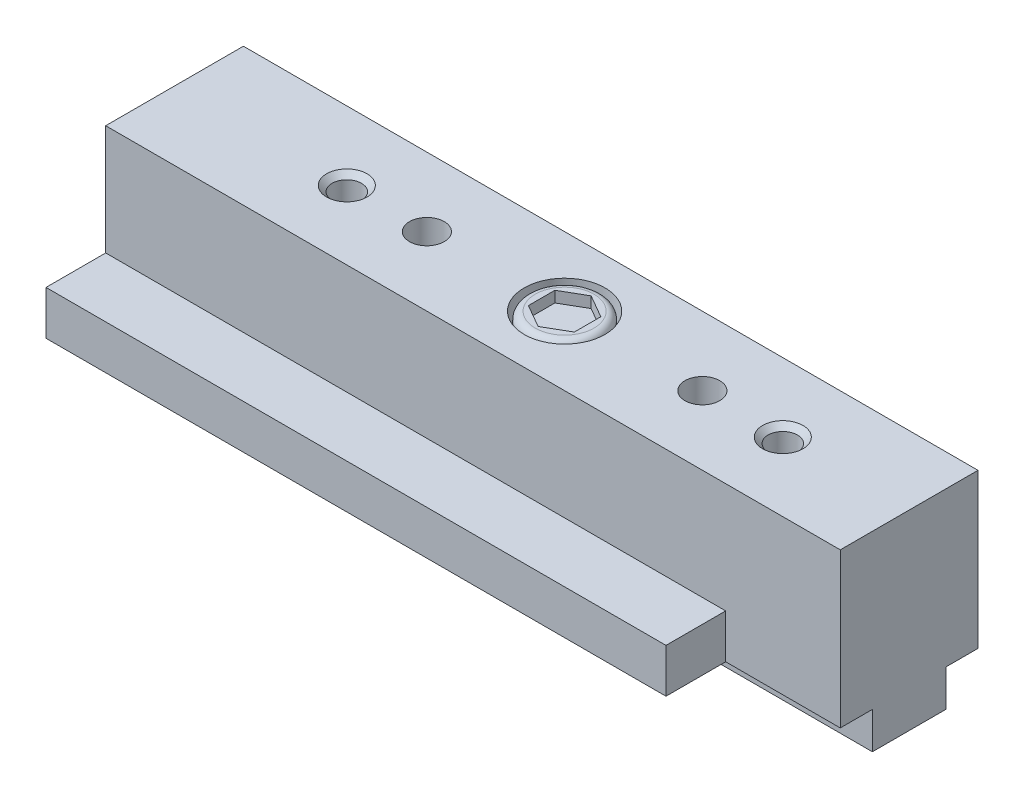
ISO-10303-21;
HEADER;
FILE_DESCRIPTION(('STEP AP214'),'2;1');
FILE_NAME('part.step','',(''),(''),'','','');
FILE_SCHEMA(('AUTOMOTIVE_DESIGN { 1 0 10303 214 1 1 1 1 }'));
ENDSEC;
DATA;
#1=APPLICATION_CONTEXT('core data for automotive mechanical design processes');
#2=APPLICATION_PROTOCOL_DEFINITION('international standard','automotive_design',2000,#1);
#3=PRODUCT_CONTEXT('',#1,'mechanical');
#4=PRODUCT('Part','Part','',(#3));
#5=PRODUCT_RELATED_PRODUCT_CATEGORY('part','',(#4));
#6=PRODUCT_DEFINITION_FORMATION('','',#4);
#7=PRODUCT_DEFINITION_CONTEXT('part definition',#1,'design');
#8=PRODUCT_DEFINITION('design','',#6,#7);
#9=PRODUCT_DEFINITION_SHAPE('','',#8);
#10=(LENGTH_UNIT() NAMED_UNIT(*) SI_UNIT(.MILLI.,.METRE.));
#11=(NAMED_UNIT(*) PLANE_ANGLE_UNIT() SI_UNIT($,.RADIAN.));
#12=(NAMED_UNIT(*) SI_UNIT($,.STERADIAN.) SOLID_ANGLE_UNIT());
#13=UNCERTAINTY_MEASURE_WITH_UNIT(LENGTH_MEASURE(1.E-05),#10,'distance_accuracy_value','');
#14=(GEOMETRIC_REPRESENTATION_CONTEXT(3) GLOBAL_UNCERTAINTY_ASSIGNED_CONTEXT((#13)) GLOBAL_UNIT_ASSIGNED_CONTEXT((#10,
#11,#12)) REPRESENTATION_CONTEXT('',''));
#15=CARTESIAN_POINT('',(0.,0.,0.));
#16=DIRECTION('',(0.,0.,1.));
#17=DIRECTION('',(1.,0.,0.));
#18=AXIS2_PLACEMENT_3D('',#15,#16,#17);
#19=CARTESIAN_POINT('',(26.9748,11.684,0.));
#20=DIRECTION('',(0.,1.,0.));
#21=DIRECTION('',(0.,0.,1.));
#22=AXIS2_PLACEMENT_3D('',#19,#20,#21);
#23=PLANE('',#22);
#24=CARTESIAN_POINT('',(26.9748,11.684,0.));
#25=DIRECTION('',(0.,1.,0.));
#26=DIRECTION('',(0.,0.,1.));
#27=AXIS2_PLACEMENT_3D('',#24,#25,#26);
#28=CIRCLE('',#27,2.794);
#29=CARTESIAN_POINT('',(26.9748,11.684,2.794));
#30=VERTEX_POINT('',#29);
#31=EDGE_CURVE('E242',#30,#30,#28,.T.);
#32=ORIENTED_EDGE('',*,*,#31,.T.);
#33=EDGE_LOOP('',(#32));
#34=FACE_BOUND('',#33,.T.);
#35=CARTESIAN_POINT('',(26.9748,11.684,0.));
#36=DIRECTION('',(0.,1.,0.));
#37=DIRECTION('',(0.,0.,1.));
#38=AXIS2_PLACEMENT_3D('',#35,#36,#37);
#39=CIRCLE('',#38,2.54);
#40=CARTESIAN_POINT('',(26.9748,11.684,2.54));
#41=VERTEX_POINT('',#40);
#42=EDGE_CURVE('E225',#41,#41,#39,.T.);
#43=ORIENTED_EDGE('',*,*,#42,.F.);
#44=EDGE_LOOP('',(#43));
#45=FACE_BOUND('',#44,.T.);
#46=ADVANCED_FACE('F33',(#34,#45),#23,.T.);
#47=CARTESIAN_POINT('',(42.8752,13.208,-4.7625));
#48=DIRECTION('',(0.,-1.,0.));
#49=DIRECTION('',(0.,0.,-1.));
#50=AXIS2_PLACEMENT_3D('',#47,#48,#49);
#51=PLANE('',#50);
#52=CARTESIAN_POINT('',(26.9748,13.208,0.));
#53=DIRECTION('',(0.,1.,0.));
#54=DIRECTION('',(0.,0.,1.));
#55=AXIS2_PLACEMENT_3D('',#52,#53,#54);
#56=CIRCLE('',#55,2.794);
#57=CARTESIAN_POINT('',(26.9748,13.208,2.794));
#58=VERTEX_POINT('',#57);
#59=EDGE_CURVE('E241',#58,#58,#56,.T.);
#60=ORIENTED_EDGE('',*,*,#59,.F.);
#61=EDGE_LOOP('',(#60));
#62=FACE_BOUND('',#61,.T.);
#63=CARTESIAN_POINT('',(17.4498,13.208,0.));
#64=DIRECTION('',(0.,1.,0.));
#65=DIRECTION('',(0.,0.,1.));
#66=AXIS2_PLACEMENT_3D('',#63,#64,#65);
#67=CIRCLE('',#66,1.20269);
#68=CARTESIAN_POINT('',(17.4498,13.208,1.20269));
#69=VERTEX_POINT('',#68);
#70=EDGE_CURVE('E245',#69,#69,#67,.T.);
#71=ORIENTED_EDGE('',*,*,#70,.F.);
#72=EDGE_LOOP('',(#71));
#73=FACE_BOUND('',#72,.T.);
#74=CARTESIAN_POINT('',(36.4998,13.208,0.));
#75=DIRECTION('',(0.,1.,0.));
#76=DIRECTION('',(0.,0.,1.));
#77=AXIS2_PLACEMENT_3D('',#74,#75,#76);
#78=CIRCLE('',#77,1.20269);
#79=CARTESIAN_POINT('',(36.4998,13.208,1.20269));
#80=VERTEX_POINT('',#79);
#81=EDGE_CURVE('E251',#80,#80,#78,.T.);
#82=ORIENTED_EDGE('',*,*,#81,.F.);
#83=EDGE_LOOP('',(#82));
#84=FACE_BOUND('',#83,.T.);
#85=CARTESIAN_POINT('',(42.0624,13.208,0.));
#86=DIRECTION('',(0.,1.,0.));
#87=DIRECTION('',(0.,0.,1.));
#88=AXIS2_PLACEMENT_3D('',#85,#86,#87);
#89=CIRCLE('',#88,1.397);
#90=CARTESIAN_POINT('',(42.0624,13.208,1.397));
#91=VERTEX_POINT('',#90);
#92=EDGE_CURVE('E274',#91,#91,#89,.T.);
#93=ORIENTED_EDGE('',*,*,#92,.F.);
#94=EDGE_LOOP('',(#93));
#95=FACE_BOUND('',#94,.T.);
#96=DIRECTION('',(0.,0.,1.));
#97=VECTOR('',#96,1.);
#98=CARTESIAN_POINT('',(0.,13.208,-4.7625));
#99=LINE('',#98,#97);
#100=CARTESIAN_POINT('',(0.,13.208,-4.7625));
#101=VERTEX_POINT('',#100);
#102=CARTESIAN_POINT('',(0.,13.208,4.7625));
#103=VERTEX_POINT('',#102);
#104=EDGE_CURVE('E400',#101,#103,#99,.T.);
#105=ORIENTED_EDGE('',*,*,#104,.T.);
#106=DIRECTION('',(-1.,0.,0.));
#107=VECTOR('',#106,1.);
#108=CARTESIAN_POINT('',(42.8752,13.208,4.7625));
#109=LINE('',#108,#107);
#110=CARTESIAN_POINT('',(50.8,13.208,4.7625));
#111=VERTEX_POINT('',#110);
#112=EDGE_CURVE('E336',#111,#103,#109,.T.);
#113=ORIENTED_EDGE('',*,*,#112,.F.);
#114=DIRECTION('',(0.,0.,1.));
#115=VECTOR('',#114,1.);
#116=CARTESIAN_POINT('',(50.8,13.208,-4.7625));
#117=LINE('',#116,#115);
#118=CARTESIAN_POINT('',(50.8,13.208,-4.7625));
#119=VERTEX_POINT('',#118);
#120=EDGE_CURVE('E297',#119,#111,#117,.T.);
#121=ORIENTED_EDGE('',*,*,#120,.F.);
#122=DIRECTION('',(-1.,0.,0.));
#123=VECTOR('',#122,1.);
#124=CARTESIAN_POINT('',(42.8752,13.208,-4.7625));
#125=LINE('',#124,#123);
#126=EDGE_CURVE('E320',#119,#101,#125,.T.);
#127=ORIENTED_EDGE('',*,*,#126,.T.);
#128=EDGE_LOOP('',(#105,#113,#121,#127));
#129=FACE_BOUND('',#128,.T.);
#130=CARTESIAN_POINT('',(11.9126,13.208,0.));
#131=DIRECTION('',(0.,1.,0.));
#132=DIRECTION('',(0.,0.,1.));
#133=AXIS2_PLACEMENT_3D('',#130,#131,#132);
#134=CIRCLE('',#133,1.397);
#135=CARTESIAN_POINT('',(11.9126,13.208,1.397));
#136=VERTEX_POINT('',#135);
#137=EDGE_CURVE('E265',#136,#136,#134,.T.);
#138=ORIENTED_EDGE('',*,*,#137,.F.);
#139=EDGE_LOOP('',(#138));
#140=FACE_BOUND('',#139,.T.);
#141=ADVANCED_FACE('F428',(#62,#73,#84,#95,#129,#140),#51,.F.);
#142=CARTESIAN_POINT('',(42.8752,2.54,8.89));
#143=DIRECTION('',(1.,0.,0.));
#144=DIRECTION('',(0.,0.,-1.));
#145=AXIS2_PLACEMENT_3D('',#142,#143,#144);
#146=PLANE('',#145);
#147=DIRECTION('',(0.,-1.,0.));
#148=VECTOR('',#147,1.);
#149=CARTESIAN_POINT('',(42.8752,13.208,4.7625));
#150=LINE('',#149,#148);
#151=CARTESIAN_POINT('',(42.8752,5.588,4.7625));
#152=VERTEX_POINT('',#151);
#153=CARTESIAN_POINT('',(42.8752,2.54,4.7625));
#154=VERTEX_POINT('',#153);
#155=EDGE_CURVE('E11',#152,#154,#150,.T.);
#156=ORIENTED_EDGE('',*,*,#155,.F.);
#157=DIRECTION('',(0.,0.,1.));
#158=VECTOR('',#157,1.);
#159=CARTESIAN_POINT('',(42.8752,5.588,4.7625));
#160=LINE('',#159,#158);
#161=CARTESIAN_POINT('',(42.8752,5.588,8.89));
#162=VERTEX_POINT('',#161);
#163=EDGE_CURVE('E312',#152,#162,#160,.T.);
#164=ORIENTED_EDGE('',*,*,#163,.T.);
#165=DIRECTION('',(0.,-1.,0.));
#166=VECTOR('',#165,1.);
#167=CARTESIAN_POINT('',(42.8752,5.588,8.89));
#168=LINE('',#167,#166);
#169=CARTESIAN_POINT('',(42.8752,2.54,8.89));
#170=VERTEX_POINT('',#169);
#171=EDGE_CURVE('E377',#162,#170,#168,.T.);
#172=ORIENTED_EDGE('',*,*,#171,.T.);
#173=DIRECTION('',(0.,0.,-1.));
#174=VECTOR('',#173,1.);
#175=CARTESIAN_POINT('',(42.8752,2.54,8.89));
#176=LINE('',#175,#174);
#177=EDGE_CURVE('E375',#170,#154,#176,.T.);
#178=ORIENTED_EDGE('',*,*,#177,.T.);
#179=EDGE_LOOP('',(#156,#164,#172,#178));
#180=FACE_BOUND('',#179,.T.);
#181=ADVANCED_FACE('F408',(#180),#146,.T.);
#182=CARTESIAN_POINT('',(42.8752,5.588,8.89));
#183=DIRECTION('',(0.,0.,-1.));
#184=DIRECTION('',(-1.,0.,0.));
#185=AXIS2_PLACEMENT_3D('',#182,#183,#184);
#186=PLANE('',#185);
#187=DIRECTION('',(0.,-1.,0.));
#188=VECTOR('',#187,1.);
#189=CARTESIAN_POINT('',(0.,5.588,8.89));
#190=LINE('',#189,#188);
#191=CARTESIAN_POINT('',(0.,5.588,8.89));
#192=VERTEX_POINT('',#191);
#193=CARTESIAN_POINT('',(0.,2.54,8.89));
#194=VERTEX_POINT('',#193);
#195=EDGE_CURVE('E330',#192,#194,#190,.T.);
#196=ORIENTED_EDGE('',*,*,#195,.T.);
#197=DIRECTION('',(-1.,0.,0.));
#198=VECTOR('',#197,1.);
#199=CARTESIAN_POINT('',(42.8752,2.54,8.89));
#200=LINE('',#199,#198);
#201=EDGE_CURVE('E42',#170,#194,#200,.T.);
#202=ORIENTED_EDGE('',*,*,#201,.F.);
#203=ORIENTED_EDGE('',*,*,#171,.F.);
#204=DIRECTION('',(-1.,0.,0.));
#205=VECTOR('',#204,1.);
#206=CARTESIAN_POINT('',(42.8752,5.588,8.89));
#207=LINE('',#206,#205);
#208=EDGE_CURVE('E337',#162,#192,#207,.T.);
#209=ORIENTED_EDGE('',*,*,#208,.T.);
#210=EDGE_LOOP('',(#196,#202,#203,#209));
#211=FACE_BOUND('',#210,.T.);
#212=ADVANCED_FACE('F35',(#211),#186,.F.);
#213=CARTESIAN_POINT('',(42.8752,2.54,8.89));
#214=DIRECTION('',(0.,1.,0.));
#215=DIRECTION('',(0.,0.,1.));
#216=AXIS2_PLACEMENT_3D('',#213,#214,#215);
#217=PLANE('',#216);
#218=DIRECTION('',(0.,0.,-1.));
#219=VECTOR('',#218,1.);
#220=CARTESIAN_POINT('',(0.,2.54,8.89));
#221=LINE('',#220,#219);
#222=CARTESIAN_POINT('',(0.,2.54,2.54));
#223=VERTEX_POINT('',#222);
#224=EDGE_CURVE('E384',#194,#223,#221,.T.);
#225=ORIENTED_EDGE('',*,*,#224,.T.);
#226=DIRECTION('',(-1.,0.,0.));
#227=VECTOR('',#226,1.);
#228=CARTESIAN_POINT('',(42.8752,2.54,2.54));
#229=LINE('',#228,#227);
#230=CARTESIAN_POINT('',(50.8,2.54,2.54));
#231=VERTEX_POINT('',#230);
#232=EDGE_CURVE('E371',#231,#223,#229,.T.);
#233=ORIENTED_EDGE('',*,*,#232,.F.);
#234=DIRECTION('',(0.,0.,-1.));
#235=VECTOR('',#234,1.);
#236=CARTESIAN_POINT('',(50.8,2.54,4.7625));
#237=LINE('',#236,#235);
#238=CARTESIAN_POINT('',(50.8,2.54,4.7625));
#239=VERTEX_POINT('',#238);
#240=EDGE_CURVE('E280',#239,#231,#237,.T.);
#241=ORIENTED_EDGE('',*,*,#240,.F.);
#242=DIRECTION('',(-1.,0.,0.));
#243=VECTOR('',#242,1.);
#244=CARTESIAN_POINT('',(50.8,2.54,4.7625));
#245=LINE('',#244,#243);
#246=EDGE_CURVE('E325',#239,#154,#245,.T.);
#247=ORIENTED_EDGE('',*,*,#246,.T.);
#248=ORIENTED_EDGE('',*,*,#177,.F.);
#249=ORIENTED_EDGE('',*,*,#201,.T.);
#250=EDGE_LOOP('',(#225,#233,#241,#247,#248,#249));
#251=FACE_BOUND('',#250,.T.);
#252=ADVANCED_FACE('F410',(#251),#217,.F.);
#253=CARTESIAN_POINT('',(42.8752,2.54,2.54));
#254=DIRECTION('',(0.,0.,-1.));
#255=DIRECTION('',(-1.,0.,0.));
#256=AXIS2_PLACEMENT_3D('',#253,#254,#255);
#257=PLANE('',#256);
#258=DIRECTION('',(0.,-1.,0.));
#259=VECTOR('',#258,1.);
#260=CARTESIAN_POINT('',(0.,2.54,2.54));
#261=LINE('',#260,#259);
#262=CARTESIAN_POINT('',(0.,0.,2.54));
#263=VERTEX_POINT('',#262);
#264=EDGE_CURVE('E386',#223,#263,#261,.T.);
#265=ORIENTED_EDGE('',*,*,#264,.T.);
#266=DIRECTION('',(-1.,0.,0.));
#267=VECTOR('',#266,1.);
#268=CARTESIAN_POINT('',(42.8752,0.,2.54));
#269=LINE('',#268,#267);
#270=CARTESIAN_POINT('',(50.8,0.,2.54));
#271=VERTEX_POINT('',#270);
#272=EDGE_CURVE('E368',#271,#263,#269,.T.);
#273=ORIENTED_EDGE('',*,*,#272,.F.);
#274=DIRECTION('',(0.,-1.,0.));
#275=VECTOR('',#274,1.);
#276=CARTESIAN_POINT('',(50.8,2.54,2.54));
#277=LINE('',#276,#275);
#278=EDGE_CURVE('E283',#231,#271,#277,.T.);
#279=ORIENTED_EDGE('',*,*,#278,.F.);
#280=ORIENTED_EDGE('',*,*,#232,.T.);
#281=EDGE_LOOP('',(#265,#273,#279,#280));
#282=FACE_BOUND('',#281,.T.);
#283=ADVANCED_FACE('F496',(#282),#257,.F.);
#284=CARTESIAN_POINT('',(42.8752,0.,2.54));
#285=DIRECTION('',(0.,1.,0.));
#286=DIRECTION('',(0.,0.,1.));
#287=AXIS2_PLACEMENT_3D('',#284,#285,#286);
#288=PLANE('',#287);
#289=DIRECTION('',(0.,0.,-1.));
#290=VECTOR('',#289,1.);
#291=CARTESIAN_POINT('',(0.,0.,2.54));
#292=LINE('',#291,#290);
#293=CARTESIAN_POINT('',(0.,0.,-2.54));
#294=VERTEX_POINT('',#293);
#295=EDGE_CURVE('E388',#263,#294,#292,.T.);
#296=ORIENTED_EDGE('',*,*,#295,.T.);
#297=DIRECTION('',(-1.,0.,0.));
#298=VECTOR('',#297,1.);
#299=CARTESIAN_POINT('',(42.8752,0.,-2.54));
#300=LINE('',#299,#298);
#301=CARTESIAN_POINT('',(50.8,0.,-2.54));
#302=VERTEX_POINT('',#301);
#303=EDGE_CURVE('E365',#302,#294,#300,.T.);
#304=ORIENTED_EDGE('',*,*,#303,.F.);
#305=DIRECTION('',(0.,0.,-1.));
#306=VECTOR('',#305,1.);
#307=CARTESIAN_POINT('',(50.8,0.,2.54));
#308=LINE('',#307,#306);
#309=EDGE_CURVE('E286',#271,#302,#308,.T.);
#310=ORIENTED_EDGE('',*,*,#309,.F.);
#311=ORIENTED_EDGE('',*,*,#272,.T.);
#312=EDGE_LOOP('',(#296,#304,#310,#311));
#313=FACE_BOUND('',#312,.T.);
#314=ADVANCED_FACE('F500',(#313),#288,.F.);
#315=CARTESIAN_POINT('',(42.8752,0.,-2.54));
#316=DIRECTION('',(0.,0.,1.));
#317=DIRECTION('',(1.,0.,0.));
#318=AXIS2_PLACEMENT_3D('',#315,#316,#317);
#319=PLANE('',#318);
#320=DIRECTION('',(0.,1.,0.));
#321=VECTOR('',#320,1.);
#322=CARTESIAN_POINT('',(0.,0.,-2.54));
#323=LINE('',#322,#321);
#324=CARTESIAN_POINT('',(0.,2.54,-2.54));
#325=VERTEX_POINT('',#324);
#326=EDGE_CURVE('E390',#294,#325,#323,.T.);
#327=ORIENTED_EDGE('',*,*,#326,.T.);
#328=DIRECTION('',(-1.,0.,0.));
#329=VECTOR('',#328,1.);
#330=CARTESIAN_POINT('',(42.8752,2.54,-2.54));
#331=LINE('',#330,#329);
#332=CARTESIAN_POINT('',(50.8,2.54,-2.54));
#333=VERTEX_POINT('',#332);
#334=EDGE_CURVE('E362',#333,#325,#331,.T.);
#335=ORIENTED_EDGE('',*,*,#334,.F.);
#336=DIRECTION('',(0.,1.,0.));
#337=VECTOR('',#336,1.);
#338=CARTESIAN_POINT('',(50.8,0.,-2.54));
#339=LINE('',#338,#337);
#340=EDGE_CURVE('E289',#302,#333,#339,.T.);
#341=ORIENTED_EDGE('',*,*,#340,.F.);
#342=ORIENTED_EDGE('',*,*,#303,.T.);
#343=EDGE_LOOP('',(#327,#335,#341,#342));
#344=FACE_BOUND('',#343,.T.);
#345=ADVANCED_FACE('F504',(#344),#319,.F.);
#346=CARTESIAN_POINT('',(42.8752,2.54,-2.54));
#347=DIRECTION('',(0.,1.,0.));
#348=DIRECTION('',(0.,0.,1.));
#349=AXIS2_PLACEMENT_3D('',#346,#347,#348);
#350=PLANE('',#349);
#351=DIRECTION('',(0.,0.,-1.));
#352=VECTOR('',#351,1.);
#353=CARTESIAN_POINT('',(0.,2.54,-2.54));
#354=LINE('',#353,#352);
#355=CARTESIAN_POINT('',(0.,2.54,-8.89));
#356=VERTEX_POINT('',#355);
#357=EDGE_CURVE('E392',#325,#356,#354,.T.);
#358=ORIENTED_EDGE('',*,*,#357,.T.);
#359=DIRECTION('',(-1.,0.,0.));
#360=VECTOR('',#359,1.);
#361=CARTESIAN_POINT('',(42.8752,2.54,-8.89));
#362=LINE('',#361,#360);
#363=CARTESIAN_POINT('',(42.8752,2.54,-8.89));
#364=VERTEX_POINT('',#363);
#365=EDGE_CURVE('E359',#364,#356,#362,.T.);
#366=ORIENTED_EDGE('',*,*,#365,.F.);
#367=DIRECTION('',(0.,0.,-1.));
#368=VECTOR('',#367,1.);
#369=CARTESIAN_POINT('',(42.8752,2.54,-2.54));
#370=LINE('',#369,#368);
#371=CARTESIAN_POINT('',(42.8752,2.54,-4.7625));
#372=VERTEX_POINT('',#371);
#373=EDGE_CURVE('E307',#372,#364,#370,.T.);
#374=ORIENTED_EDGE('',*,*,#373,.F.);
#375=DIRECTION('',(-1.,0.,0.));
#376=VECTOR('',#375,1.);
#377=CARTESIAN_POINT('',(50.8,2.54,-4.7625));
#378=LINE('',#377,#376);
#379=CARTESIAN_POINT('',(50.8,2.54,-4.7625));
#380=VERTEX_POINT('',#379);
#381=EDGE_CURVE('E300',#380,#372,#378,.T.);
#382=ORIENTED_EDGE('',*,*,#381,.F.);
#383=DIRECTION('',(0.,0.,-1.));
#384=VECTOR('',#383,1.);
#385=CARTESIAN_POINT('',(50.8,2.54,-2.54));
#386=LINE('',#385,#384);
#387=EDGE_CURVE('E292',#333,#380,#386,.T.);
#388=ORIENTED_EDGE('',*,*,#387,.F.);
#389=ORIENTED_EDGE('',*,*,#334,.T.);
#390=EDGE_LOOP('',(#358,#366,#374,#382,#388,#389));
#391=FACE_BOUND('',#390,.T.);
#392=ADVANCED_FACE('F507',(#391),#350,.F.);
#393=CARTESIAN_POINT('',(42.8752,2.54,-8.89));
#394=DIRECTION('',(0.,0.,1.));
#395=DIRECTION('',(1.,0.,0.));
#396=AXIS2_PLACEMENT_3D('',#393,#394,#395);
#397=PLANE('',#396);
#398=DIRECTION('',(0.,1.,0.));
#399=VECTOR('',#398,1.);
#400=CARTESIAN_POINT('',(0.,2.54,-8.89));
#401=LINE('',#400,#399);
#402=CARTESIAN_POINT('',(0.,5.588,-8.89));
#403=VERTEX_POINT('',#402);
#404=EDGE_CURVE('E394',#356,#403,#401,.T.);
#405=ORIENTED_EDGE('',*,*,#404,.T.);
#406=DIRECTION('',(-1.,0.,0.));
#407=VECTOR('',#406,1.);
#408=CARTESIAN_POINT('',(42.8752,5.588,-8.89));
#409=LINE('',#408,#407);
#410=CARTESIAN_POINT('',(42.8752,5.588,-8.89));
#411=VERTEX_POINT('',#410);
#412=EDGE_CURVE('E319',#411,#403,#409,.T.);
#413=ORIENTED_EDGE('',*,*,#412,.F.);
#414=DIRECTION('',(0.,1.,0.));
#415=VECTOR('',#414,1.);
#416=CARTESIAN_POINT('',(42.8752,2.54,-8.89));
#417=LINE('',#416,#415);
#418=EDGE_CURVE('E313',#364,#411,#417,.T.);
#419=ORIENTED_EDGE('',*,*,#418,.F.);
#420=ORIENTED_EDGE('',*,*,#365,.T.);
#421=EDGE_LOOP('',(#405,#413,#419,#420));
#422=FACE_BOUND('',#421,.T.);
#423=ADVANCED_FACE('F515',(#422),#397,.F.);
#424=CARTESIAN_POINT('',(42.8752,5.588,-8.89));
#425=DIRECTION('',(0.,-1.,0.));
#426=DIRECTION('',(0.,0.,-1.));
#427=AXIS2_PLACEMENT_3D('',#424,#425,#426);
#428=PLANE('',#427);
#429=DIRECTION('',(0.,0.,1.));
#430=VECTOR('',#429,1.);
#431=CARTESIAN_POINT('',(0.,5.588,-8.89));
#432=LINE('',#431,#430);
#433=CARTESIAN_POINT('',(0.,5.588,-4.7625));
#434=VERTEX_POINT('',#433);
#435=EDGE_CURVE('E396',#403,#434,#432,.T.);
#436=ORIENTED_EDGE('',*,*,#435,.T.);
#437=DIRECTION('',(-1.,0.,0.));
#438=VECTOR('',#437,1.);
#439=CARTESIAN_POINT('',(42.8752,5.588,-4.7625));
#440=LINE('',#439,#438);
#441=CARTESIAN_POINT('',(42.8752,5.588,-4.7625));
#442=VERTEX_POINT('',#441);
#443=EDGE_CURVE('E316',#442,#434,#440,.T.);
#444=ORIENTED_EDGE('',*,*,#443,.F.);
#445=DIRECTION('',(0.,0.,1.));
#446=VECTOR('',#445,1.);
#447=CARTESIAN_POINT('',(42.8752,5.588,-8.89));
#448=LINE('',#447,#446);
#449=EDGE_CURVE('E310',#411,#442,#448,.T.);
#450=ORIENTED_EDGE('',*,*,#449,.F.);
#451=ORIENTED_EDGE('',*,*,#412,.T.);
#452=EDGE_LOOP('',(#436,#444,#450,#451));
#453=FACE_BOUND('',#452,.T.);
#454=ADVANCED_FACE('F519',(#453),#428,.F.);
#455=CARTESIAN_POINT('',(42.8752,5.588,-4.7625));
#456=DIRECTION('',(0.,0.,1.));
#457=DIRECTION('',(1.,0.,0.));
#458=AXIS2_PLACEMENT_3D('',#455,#456,#457);
#459=PLANE('',#458);
#460=DIRECTION('',(0.,1.,0.));
#461=VECTOR('',#460,1.);
#462=CARTESIAN_POINT('',(0.,5.588,-4.7625));
#463=LINE('',#462,#461);
#464=EDGE_CURVE('E398',#434,#101,#463,.T.);
#465=ORIENTED_EDGE('',*,*,#464,.T.);
#466=ORIENTED_EDGE('',*,*,#126,.F.);
#467=DIRECTION('',(0.,1.,0.));
#468=VECTOR('',#467,1.);
#469=CARTESIAN_POINT('',(50.8,2.54,-4.7625));
#470=LINE('',#469,#468);
#471=EDGE_CURVE('E294',#380,#119,#470,.T.);
#472=ORIENTED_EDGE('',*,*,#471,.F.);
#473=ORIENTED_EDGE('',*,*,#381,.T.);
#474=DIRECTION('',(0.,1.,0.));
#475=VECTOR('',#474,1.);
#476=CARTESIAN_POINT('',(42.8752,2.54,-4.7625));
#477=LINE('',#476,#475);
#478=EDGE_CURVE('E58',#372,#442,#477,.T.);
#479=ORIENTED_EDGE('',*,*,#478,.T.);
#480=ORIENTED_EDGE('',*,*,#443,.T.);
#481=EDGE_LOOP('',(#465,#466,#472,#473,#479,#480));
#482=FACE_BOUND('',#481,.T.);
#483=ADVANCED_FACE('F424',(#482),#459,.F.);
#484=CARTESIAN_POINT('',(42.8752,13.208,4.7625));
#485=DIRECTION('',(0.,0.,-1.));
#486=DIRECTION('',(-1.,0.,0.));
#487=AXIS2_PLACEMENT_3D('',#484,#485,#486);
#488=PLANE('',#487);
#489=DIRECTION('',(0.,-1.,0.));
#490=VECTOR('',#489,1.);
#491=CARTESIAN_POINT('',(0.,13.208,4.7625));
#492=LINE('',#491,#490);
#493=CARTESIAN_POINT('',(0.,5.588,4.7625));
#494=VERTEX_POINT('',#493);
#495=EDGE_CURVE('E401',#103,#494,#492,.T.);
#496=ORIENTED_EDGE('',*,*,#495,.T.);
#497=DIRECTION('',(-1.,0.,0.));
#498=VECTOR('',#497,1.);
#499=CARTESIAN_POINT('',(42.8752,5.588,4.7625));
#500=LINE('',#499,#498);
#501=EDGE_CURVE('E333',#152,#494,#500,.T.);
#502=ORIENTED_EDGE('',*,*,#501,.F.);
#503=ORIENTED_EDGE('',*,*,#155,.T.);
#504=ORIENTED_EDGE('',*,*,#246,.F.);
#505=DIRECTION('',(0.,-1.,0.));
#506=VECTOR('',#505,1.);
#507=CARTESIAN_POINT('',(50.8,13.208,4.7625));
#508=LINE('',#507,#506);
#509=EDGE_CURVE('E277',#111,#239,#508,.T.);
#510=ORIENTED_EDGE('',*,*,#509,.F.);
#511=ORIENTED_EDGE('',*,*,#112,.T.);
#512=EDGE_LOOP('',(#496,#502,#503,#504,#510,#511));
#513=FACE_BOUND('',#512,.T.);
#514=ADVANCED_FACE('F413',(#513),#488,.F.);
#515=CARTESIAN_POINT('',(42.8752,5.588,4.7625));
#516=DIRECTION('',(0.,-1.,0.));
#517=DIRECTION('',(0.,0.,-1.));
#518=AXIS2_PLACEMENT_3D('',#515,#516,#517);
#519=PLANE('',#518);
#520=DIRECTION('',(0.,0.,1.));
#521=VECTOR('',#520,1.);
#522=CARTESIAN_POINT('',(0.,5.588,4.7625));
#523=LINE('',#522,#521);
#524=EDGE_CURVE('E351',#494,#192,#523,.T.);
#525=ORIENTED_EDGE('',*,*,#524,.T.);
#526=ORIENTED_EDGE('',*,*,#208,.F.);
#527=ORIENTED_EDGE('',*,*,#163,.F.);
#528=ORIENTED_EDGE('',*,*,#501,.T.);
#529=EDGE_LOOP('',(#525,#526,#527,#528));
#530=FACE_BOUND('',#529,.T.);
#531=ADVANCED_FACE('F414',(#530),#519,.F.);
#532=ORIENTED_EDGE('',*,*,#478,.F.);
#533=ORIENTED_EDGE('',*,*,#373,.T.);
#534=ORIENTED_EDGE('',*,*,#418,.T.);
#535=ORIENTED_EDGE('',*,*,#449,.T.);
#536=EDGE_LOOP('',(#532,#533,#534,#535));
#537=FACE_BOUND('',#536,.T.);
#538=ADVANCED_FACE('F416',(#537),#146,.T.);
#539=CARTESIAN_POINT('',(0.,2.54,8.89));
#540=DIRECTION('',(1.,0.,0.));
#541=DIRECTION('',(0.,0.,-1.));
#542=AXIS2_PLACEMENT_3D('',#539,#540,#541);
#543=PLANE('',#542);
#544=ORIENTED_EDGE('',*,*,#195,.F.);
#545=ORIENTED_EDGE('',*,*,#524,.F.);
#546=ORIENTED_EDGE('',*,*,#495,.F.);
#547=ORIENTED_EDGE('',*,*,#104,.F.);
#548=ORIENTED_EDGE('',*,*,#464,.F.);
#549=ORIENTED_EDGE('',*,*,#435,.F.);
#550=ORIENTED_EDGE('',*,*,#404,.F.);
#551=ORIENTED_EDGE('',*,*,#357,.F.);
#552=ORIENTED_EDGE('',*,*,#326,.F.);
#553=ORIENTED_EDGE('',*,*,#295,.F.);
#554=ORIENTED_EDGE('',*,*,#264,.F.);
#555=ORIENTED_EDGE('',*,*,#224,.F.);
#556=EDGE_LOOP('',(#544,#545,#546,#547,#548,#549,#550,#551,#552,#553,#554,#555));
#557=FACE_BOUND('',#556,.T.);
#558=ADVANCED_FACE('F422',(#557),#543,.F.);
#559=CARTESIAN_POINT('',(50.8,2.54,4.7625));
#560=DIRECTION('',(1.,0.,0.));
#561=DIRECTION('',(0.,0.,-1.));
#562=AXIS2_PLACEMENT_3D('',#559,#560,#561);
#563=PLANE('',#562);
#564=ORIENTED_EDGE('',*,*,#509,.T.);
#565=ORIENTED_EDGE('',*,*,#240,.T.);
#566=ORIENTED_EDGE('',*,*,#278,.T.);
#567=ORIENTED_EDGE('',*,*,#309,.T.);
#568=ORIENTED_EDGE('',*,*,#340,.T.);
#569=ORIENTED_EDGE('',*,*,#387,.T.);
#570=ORIENTED_EDGE('',*,*,#471,.T.);
#571=ORIENTED_EDGE('',*,*,#120,.T.);
#572=EDGE_LOOP('',(#564,#565,#566,#567,#568,#569,#570,#571));
#573=FACE_BOUND('',#572,.T.);
#574=ADVANCED_FACE('F484',(#573),#563,.T.);
#575=CARTESIAN_POINT('',(42.0624,12.827,0.));
#576=DIRECTION('',(0.,1.,0.));
#577=DIRECTION('',(0.,0.,1.));
#578=AXIS2_PLACEMENT_3D('',#575,#576,#577);
#579=CONICAL_SURFACE('',#578,1.016,0.785398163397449);
#580=ORIENTED_EDGE('',*,*,#92,.T.);
#581=EDGE_LOOP('',(#580));
#582=FACE_BOUND('',#581,.T.);
#583=CARTESIAN_POINT('',(42.0624,12.827,0.));
#584=DIRECTION('',(0.,1.,0.));
#585=DIRECTION('',(0.,0.,1.));
#586=AXIS2_PLACEMENT_3D('',#583,#584,#585);
#587=CIRCLE('',#586,1.016);
#588=CARTESIAN_POINT('',(42.0624,12.827,1.016));
#589=VERTEX_POINT('',#588);
#590=EDGE_CURVE('E271',#589,#589,#587,.T.);
#591=ORIENTED_EDGE('',*,*,#590,.F.);
#592=EDGE_LOOP('',(#591));
#593=FACE_BOUND('',#592,.T.);
#594=ADVANCED_FACE('F480',(#582,#593),#579,.F.);
#595=CARTESIAN_POINT('',(42.0624,4.953,0.));
#596=DIRECTION('',(0.,1.,0.));
#597=DIRECTION('',(0.,0.,1.));
#598=AXIS2_PLACEMENT_3D('',#595,#596,#597);
#599=CYLINDRICAL_SURFACE('',#598,1.016);
#600=ORIENTED_EDGE('',*,*,#590,.T.);
#601=EDGE_LOOP('',(#600));
#602=FACE_BOUND('',#601,.T.);
#603=CARTESIAN_POINT('',(42.0624,5.5395878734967,0.));
#604=DIRECTION('',(0.,1.,0.));
#605=DIRECTION('',(0.,0.,1.));
#606=AXIS2_PLACEMENT_3D('',#603,#604,#605);
#607=CIRCLE('',#606,1.016);
#608=CARTESIAN_POINT('',(42.0624,5.5395878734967,1.016));
#609=VERTEX_POINT('',#608);
#610=EDGE_CURVE('E268',#609,#609,#607,.T.);
#611=ORIENTED_EDGE('',*,*,#610,.F.);
#612=EDGE_LOOP('',(#611));
#613=FACE_BOUND('',#612,.T.);
#614=ADVANCED_FACE('F476',(#602,#613),#599,.F.);
#615=CARTESIAN_POINT('',(42.0624,4.953,0.));
#616=DIRECTION('',(0.,1.,0.));
#617=DIRECTION('',(0.,0.,1.));
#618=AXIS2_PLACEMENT_3D('',#615,#616,#617);
#619=CONICAL_SURFACE('',#618,0.,1.04719755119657);
#620=ORIENTED_EDGE('',*,*,#610,.T.);
#621=EDGE_LOOP('',(#620));
#622=FACE_BOUND('',#621,.T.);
#623=CARTESIAN_POINT('',(42.0624,4.953,0.));
#624=VERTEX_POINT('',#623);
#625=VERTEX_LOOP('',#624);
#626=FACE_BOUND('',#625,.T.);
#627=ADVANCED_FACE('F472',(#622,#626),#619,.F.);
#628=CARTESIAN_POINT('',(11.9126,12.827,0.));
#629=DIRECTION('',(0.,1.,0.));
#630=DIRECTION('',(0.,0.,1.));
#631=AXIS2_PLACEMENT_3D('',#628,#629,#630);
#632=CONICAL_SURFACE('',#631,1.016,0.785398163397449);
#633=ORIENTED_EDGE('',*,*,#137,.T.);
#634=EDGE_LOOP('',(#633));
#635=FACE_BOUND('',#634,.T.);
#636=CARTESIAN_POINT('',(11.9126,12.827,0.));
#637=DIRECTION('',(0.,1.,0.));
#638=DIRECTION('',(0.,0.,1.));
#639=AXIS2_PLACEMENT_3D('',#636,#637,#638);
#640=CIRCLE('',#639,1.016);
#641=CARTESIAN_POINT('',(11.9126,12.827,1.016));
#642=VERTEX_POINT('',#641);
#643=EDGE_CURVE('E262',#642,#642,#640,.T.);
#644=ORIENTED_EDGE('',*,*,#643,.F.);
#645=EDGE_LOOP('',(#644));
#646=FACE_BOUND('',#645,.T.);
#647=ADVANCED_FACE('F468',(#635,#646),#632,.F.);
#648=CARTESIAN_POINT('',(11.9126,4.953,0.));
#649=DIRECTION('',(0.,1.,0.));
#650=DIRECTION('',(0.,0.,1.));
#651=AXIS2_PLACEMENT_3D('',#648,#649,#650);
#652=CYLINDRICAL_SURFACE('',#651,1.016);
#653=ORIENTED_EDGE('',*,*,#643,.T.);
#654=EDGE_LOOP('',(#653));
#655=FACE_BOUND('',#654,.T.);
#656=CARTESIAN_POINT('',(11.9126,5.5395878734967,0.));
#657=DIRECTION('',(0.,1.,0.));
#658=DIRECTION('',(0.,0.,1.));
#659=AXIS2_PLACEMENT_3D('',#656,#657,#658);
#660=CIRCLE('',#659,1.016);
#661=CARTESIAN_POINT('',(11.9126,5.5395878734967,1.016));
#662=VERTEX_POINT('',#661);
#663=EDGE_CURVE('E257',#662,#662,#660,.T.);
#664=ORIENTED_EDGE('',*,*,#663,.F.);
#665=EDGE_LOOP('',(#664));
#666=FACE_BOUND('',#665,.T.);
#667=ADVANCED_FACE('F464',(#655,#666),#652,.F.);
#668=CARTESIAN_POINT('',(11.9126,4.953,0.));
#669=DIRECTION('',(0.,1.,0.));
#670=DIRECTION('',(0.,0.,1.));
#671=AXIS2_PLACEMENT_3D('',#668,#669,#670);
#672=CONICAL_SURFACE('',#671,0.,1.04719755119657);
#673=ORIENTED_EDGE('',*,*,#663,.T.);
#674=EDGE_LOOP('',(#673));
#675=FACE_BOUND('',#674,.T.);
#676=CARTESIAN_POINT('',(11.9126,4.953,0.));
#677=VERTEX_POINT('',#676);
#678=VERTEX_LOOP('',#677);
#679=FACE_BOUND('',#678,.T.);
#680=ADVANCED_FACE('F460',(#675,#679),#672,.F.);
#681=CARTESIAN_POINT('',(36.4998,10.16,0.));
#682=DIRECTION('',(0.,1.,0.));
#683=DIRECTION('',(0.,0.,1.));
#684=AXIS2_PLACEMENT_3D('',#681,#682,#683);
#685=CYLINDRICAL_SURFACE('',#684,1.20269);
#686=CARTESIAN_POINT('',(36.4998,10.16,0.));
#687=DIRECTION('',(0.,1.,0.));
#688=DIRECTION('',(0.,0.,1.));
#689=AXIS2_PLACEMENT_3D('',#686,#687,#688);
#690=CIRCLE('',#689,1.20269);
#691=CARTESIAN_POINT('',(36.4998,10.16,1.20269));
#692=VERTEX_POINT('',#691);
#693=EDGE_CURVE('E254',#692,#692,#690,.T.);
#694=CARTESIAN_POINT('',(36.4998,10.16,1.20269));
#695=CARTESIAN_POINT('',(36.4998,10.19175,1.20269));
#696=CARTESIAN_POINT('',(36.4998,10.2235,1.20269));
#697=CARTESIAN_POINT('',(36.4998,10.287,1.20269));
#698=CARTESIAN_POINT('',(36.4998,10.31875,1.20269));
#699=CARTESIAN_POINT('',(36.4998,10.38225,1.20269));
#700=CARTESIAN_POINT('',(36.4998,10.414,1.20269));
#701=CARTESIAN_POINT('',(36.4998,10.4775,1.20269));
#702=CARTESIAN_POINT('',(36.4998,10.50925,1.20269));
#703=CARTESIAN_POINT('',(36.4998,10.57275,1.20269));
#704=CARTESIAN_POINT('',(36.4998,10.6045,1.20269));
#705=CARTESIAN_POINT('',(36.4998,10.668,1.20269));
#706=CARTESIAN_POINT('',(36.4998,10.69975,1.20269));
#707=CARTESIAN_POINT('',(36.4998,10.76325,1.20269));
#708=CARTESIAN_POINT('',(36.4998,10.795,1.20269));
#709=CARTESIAN_POINT('',(36.4998,10.8585,1.20269));
#710=CARTESIAN_POINT('',(36.4998,10.89025,1.20269));
#711=CARTESIAN_POINT('',(36.4998,10.95375,1.20269));
#712=CARTESIAN_POINT('',(36.4998,10.9855,1.20269));
#713=CARTESIAN_POINT('',(36.4998,11.049,1.20269));
#714=CARTESIAN_POINT('',(36.4998,11.08075,1.20269));
#715=CARTESIAN_POINT('',(36.4998,11.14425,1.20269));
#716=CARTESIAN_POINT('',(36.4998,11.176,1.20269));
#717=CARTESIAN_POINT('',(36.4998,11.2395,1.20269));
#718=CARTESIAN_POINT('',(36.4998,11.27125,1.20269));
#719=CARTESIAN_POINT('',(36.4998,11.33475,1.20269));
#720=CARTESIAN_POINT('',(36.4998,11.3665,1.20269));
#721=CARTESIAN_POINT('',(36.4998,11.43,1.20269));
#722=CARTESIAN_POINT('',(36.4998,11.46175,1.20269));
#723=CARTESIAN_POINT('',(36.4998,11.52525,1.20269));
#724=CARTESIAN_POINT('',(36.4998,11.557,1.20269));
#725=CARTESIAN_POINT('',(36.4998,11.6205,1.20269));
#726=CARTESIAN_POINT('',(36.4998,11.65225,1.20269));
#727=CARTESIAN_POINT('',(36.4998,11.71575,1.20269));
#728=CARTESIAN_POINT('',(36.4998,11.7475,1.20269));
#729=CARTESIAN_POINT('',(36.4998,11.811,1.20269));
#730=CARTESIAN_POINT('',(36.4998,11.84275,1.20269));
#731=CARTESIAN_POINT('',(36.4998,11.90625,1.20269));
#732=CARTESIAN_POINT('',(36.4998,11.938,1.20269));
#733=CARTESIAN_POINT('',(36.4998,12.0015,1.20269));
#734=CARTESIAN_POINT('',(36.4998,12.03325,1.20269));
#735=CARTESIAN_POINT('',(36.4998,12.09675,1.20269));
#736=CARTESIAN_POINT('',(36.4998,12.1285,1.20269));
#737=CARTESIAN_POINT('',(36.4998,12.192,1.20269));
#738=CARTESIAN_POINT('',(36.4998,12.22375,1.20269));
#739=CARTESIAN_POINT('',(36.4998,12.28725,1.20269));
#740=CARTESIAN_POINT('',(36.4998,12.319,1.20269));
#741=CARTESIAN_POINT('',(36.4998,12.3825,1.20269));
#742=CARTESIAN_POINT('',(36.4998,12.41425,1.20269));
#743=CARTESIAN_POINT('',(36.4998,12.47775,1.20269));
#744=CARTESIAN_POINT('',(36.4998,12.5095,1.20269));
#745=CARTESIAN_POINT('',(36.4998,12.573,1.20269));
#746=CARTESIAN_POINT('',(36.4998,12.60475,1.20269));
#747=CARTESIAN_POINT('',(36.4998,12.66825,1.20269));
#748=CARTESIAN_POINT('',(36.4998,12.7,1.20269));
#749=CARTESIAN_POINT('',(36.4998,12.7635,1.20269));
#750=CARTESIAN_POINT('',(36.4998,12.79525,1.20269));
#751=CARTESIAN_POINT('',(36.4998,12.85875,1.20269));
#752=CARTESIAN_POINT('',(36.4998,12.8905,1.20269));
#753=CARTESIAN_POINT('',(36.4998,12.954,1.20269));
#754=CARTESIAN_POINT('',(36.4998,12.98575,1.20269));
#755=CARTESIAN_POINT('',(36.4998,13.04925,1.20269));
#756=CARTESIAN_POINT('',(36.4998,13.081,1.20269));
#757=CARTESIAN_POINT('',(36.4998,13.1445,1.20269));
#758=CARTESIAN_POINT('',(36.4998,13.17625,1.20269));
#759=CARTESIAN_POINT('',(36.4998,13.208,1.20269));
#760=B_SPLINE_CURVE_WITH_KNOTS('',3,(#694,#695,#696,#697,#698,#699,#700,#701,#702,#703,#704,
#705,#706,#707,#708,#709,#710,#711,#712,#713,#714,#715,#716,#717,#718,#719,#720,#721,#722,#723,
#724,#725,#726,#727,#728,#729,#730,#731,#732,#733,#734,#735,#736,#737,#738,#739,#740,#741,#742,
#743,#744,#745,#746,#747,#748,#749,#750,#751,#752,#753,#754,#755,#756,#757,#758,#759),
.UNSPECIFIED.,.F.,.F.,(4,2,2,2,2,2,2,2,2,2,2,2,2,2,2,2,2,2,2,2,2,2,2,2,2,2,2,2,2,2,2,2,4),(0.,
0.0952499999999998,0.1905,0.28575,0.380999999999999,0.476249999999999,0.571499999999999,
0.666749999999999,0.761999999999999,0.857249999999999,0.9525,1.04775,1.143,1.23825,1.3335,
1.42875,1.524,1.61925,1.7145,1.80975,1.905,2.00025,2.0955,2.19075,2.286,2.38125,2.4765,2.57175,
2.667,2.76225,2.8575,2.95275,3.048),.UNSPECIFIED.);
#761=EDGE_CURVE('BSEAM456',#692,#80,#760,.T.);
#762=ORIENTED_EDGE('',*,*,#693,.F.);
#763=ORIENTED_EDGE('',*,*,#81,.T.);
#764=ORIENTED_EDGE('',*,*,#761,.T.);
#765=ORIENTED_EDGE('',*,*,#761,.F.);
#766=EDGE_LOOP('',(#762,#764,#763,#765));
#767=FACE_BOUND('',#766,.T.);
#768=ADVANCED_FACE('F456',(#767),#685,.F.);
#769=CARTESIAN_POINT('',(36.4998,10.16,0.));
#770=DIRECTION('',(0.,1.,0.));
#771=DIRECTION('',(0.,0.,1.));
#772=AXIS2_PLACEMENT_3D('',#769,#770,#771);
#773=PLANE('',#772);
#774=ORIENTED_EDGE('',*,*,#693,.T.);
#775=EDGE_LOOP('',(#774));
#776=FACE_BOUND('',#775,.T.);
#777=ADVANCED_FACE('F452',(#776),#773,.T.);
#778=CARTESIAN_POINT('',(17.4498,10.16,0.));
#779=DIRECTION('',(0.,1.,0.));
#780=DIRECTION('',(0.,0.,1.));
#781=AXIS2_PLACEMENT_3D('',#778,#779,#780);
#782=CYLINDRICAL_SURFACE('',#781,1.20269);
#783=CARTESIAN_POINT('',(17.4498,10.16,0.));
#784=DIRECTION('',(0.,1.,0.));
#785=DIRECTION('',(0.,0.,1.));
#786=AXIS2_PLACEMENT_3D('',#783,#784,#785);
#787=CIRCLE('',#786,1.20269);
#788=CARTESIAN_POINT('',(17.4498,10.16,1.20269));
#789=VERTEX_POINT('',#788);
#790=EDGE_CURVE('E248',#789,#789,#787,.T.);
#791=CARTESIAN_POINT('',(17.4498,10.16,1.20269));
#792=CARTESIAN_POINT('',(17.4498,10.19175,1.20269));
#793=CARTESIAN_POINT('',(17.4498,10.2235,1.20269));
#794=CARTESIAN_POINT('',(17.4498,10.287,1.20269));
#795=CARTESIAN_POINT('',(17.4498,10.31875,1.20269));
#796=CARTESIAN_POINT('',(17.4498,10.38225,1.20269));
#797=CARTESIAN_POINT('',(17.4498,10.414,1.20269));
#798=CARTESIAN_POINT('',(17.4498,10.4775,1.20269));
#799=CARTESIAN_POINT('',(17.4498,10.50925,1.20269));
#800=CARTESIAN_POINT('',(17.4498,10.57275,1.20269));
#801=CARTESIAN_POINT('',(17.4498,10.6045,1.20269));
#802=CARTESIAN_POINT('',(17.4498,10.668,1.20269));
#803=CARTESIAN_POINT('',(17.4498,10.69975,1.20269));
#804=CARTESIAN_POINT('',(17.4498,10.76325,1.20269));
#805=CARTESIAN_POINT('',(17.4498,10.795,1.20269));
#806=CARTESIAN_POINT('',(17.4498,10.8585,1.20269));
#807=CARTESIAN_POINT('',(17.4498,10.89025,1.20269));
#808=CARTESIAN_POINT('',(17.4498,10.95375,1.20269));
#809=CARTESIAN_POINT('',(17.4498,10.9855,1.20269));
#810=CARTESIAN_POINT('',(17.4498,11.049,1.20269));
#811=CARTESIAN_POINT('',(17.4498,11.08075,1.20269));
#812=CARTESIAN_POINT('',(17.4498,11.14425,1.20269));
#813=CARTESIAN_POINT('',(17.4498,11.176,1.20269));
#814=CARTESIAN_POINT('',(17.4498,11.2395,1.20269));
#815=CARTESIAN_POINT('',(17.4498,11.27125,1.20269));
#816=CARTESIAN_POINT('',(17.4498,11.33475,1.20269));
#817=CARTESIAN_POINT('',(17.4498,11.3665,1.20269));
#818=CARTESIAN_POINT('',(17.4498,11.43,1.20269));
#819=CARTESIAN_POINT('',(17.4498,11.46175,1.20269));
#820=CARTESIAN_POINT('',(17.4498,11.52525,1.20269));
#821=CARTESIAN_POINT('',(17.4498,11.557,1.20269));
#822=CARTESIAN_POINT('',(17.4498,11.6205,1.20269));
#823=CARTESIAN_POINT('',(17.4498,11.65225,1.20269));
#824=CARTESIAN_POINT('',(17.4498,11.71575,1.20269));
#825=CARTESIAN_POINT('',(17.4498,11.7475,1.20269));
#826=CARTESIAN_POINT('',(17.4498,11.811,1.20269));
#827=CARTESIAN_POINT('',(17.4498,11.84275,1.20269));
#828=CARTESIAN_POINT('',(17.4498,11.90625,1.20269));
#829=CARTESIAN_POINT('',(17.4498,11.938,1.20269));
#830=CARTESIAN_POINT('',(17.4498,12.0015,1.20269));
#831=CARTESIAN_POINT('',(17.4498,12.03325,1.20269));
#832=CARTESIAN_POINT('',(17.4498,12.09675,1.20269));
#833=CARTESIAN_POINT('',(17.4498,12.1285,1.20269));
#834=CARTESIAN_POINT('',(17.4498,12.192,1.20269));
#835=CARTESIAN_POINT('',(17.4498,12.22375,1.20269));
#836=CARTESIAN_POINT('',(17.4498,12.28725,1.20269));
#837=CARTESIAN_POINT('',(17.4498,12.319,1.20269));
#838=CARTESIAN_POINT('',(17.4498,12.3825,1.20269));
#839=CARTESIAN_POINT('',(17.4498,12.41425,1.20269));
#840=CARTESIAN_POINT('',(17.4498,12.47775,1.20269));
#841=CARTESIAN_POINT('',(17.4498,12.5095,1.20269));
#842=CARTESIAN_POINT('',(17.4498,12.573,1.20269));
#843=CARTESIAN_POINT('',(17.4498,12.60475,1.20269));
#844=CARTESIAN_POINT('',(17.4498,12.66825,1.20269));
#845=CARTESIAN_POINT('',(17.4498,12.7,1.20269));
#846=CARTESIAN_POINT('',(17.4498,12.7635,1.20269));
#847=CARTESIAN_POINT('',(17.4498,12.79525,1.20269));
#848=CARTESIAN_POINT('',(17.4498,12.85875,1.20269));
#849=CARTESIAN_POINT('',(17.4498,12.8905,1.20269));
#850=CARTESIAN_POINT('',(17.4498,12.954,1.20269));
#851=CARTESIAN_POINT('',(17.4498,12.98575,1.20269));
#852=CARTESIAN_POINT('',(17.4498,13.04925,1.20269));
#853=CARTESIAN_POINT('',(17.4498,13.081,1.20269));
#854=CARTESIAN_POINT('',(17.4498,13.1445,1.20269));
#855=CARTESIAN_POINT('',(17.4498,13.17625,1.20269));
#856=CARTESIAN_POINT('',(17.4498,13.208,1.20269));
#857=B_SPLINE_CURVE_WITH_KNOTS('',3,(#791,#792,#793,#794,#795,#796,#797,#798,#799,#800,#801,
#802,#803,#804,#805,#806,#807,#808,#809,#810,#811,#812,#813,#814,#815,#816,#817,#818,#819,#820,
#821,#822,#823,#824,#825,#826,#827,#828,#829,#830,#831,#832,#833,#834,#835,#836,#837,#838,#839,
#840,#841,#842,#843,#844,#845,#846,#847,#848,#849,#850,#851,#852,#853,#854,#855,#856),
.UNSPECIFIED.,.F.,.F.,(4,2,2,2,2,2,2,2,2,2,2,2,2,2,2,2,2,2,2,2,2,2,2,2,2,2,2,2,2,2,2,2,4),(0.,
0.0952499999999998,0.1905,0.28575,0.380999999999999,0.476249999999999,0.571499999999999,
0.666749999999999,0.761999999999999,0.857249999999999,0.9525,1.04775,1.143,1.23825,1.3335,
1.42875,1.524,1.61925,1.7145,1.80975,1.905,2.00025,2.0955,2.19075,2.286,2.38125,2.4765,2.57175,
2.667,2.76225,2.8575,2.95275,3.048),.UNSPECIFIED.);
#858=EDGE_CURVE('BSEAM448',#789,#69,#857,.T.);
#859=ORIENTED_EDGE('',*,*,#790,.F.);
#860=ORIENTED_EDGE('',*,*,#70,.T.);
#861=ORIENTED_EDGE('',*,*,#858,.T.);
#862=ORIENTED_EDGE('',*,*,#858,.F.);
#863=EDGE_LOOP('',(#859,#861,#860,#862));
#864=FACE_BOUND('',#863,.T.);
#865=ADVANCED_FACE('F448',(#864),#782,.F.);
#866=CARTESIAN_POINT('',(17.4498,10.16,0.));
#867=DIRECTION('',(0.,1.,0.));
#868=DIRECTION('',(0.,0.,1.));
#869=AXIS2_PLACEMENT_3D('',#866,#867,#868);
#870=PLANE('',#869);
#871=ORIENTED_EDGE('',*,*,#790,.T.);
#872=EDGE_LOOP('',(#871));
#873=FACE_BOUND('',#872,.T.);
#874=ADVANCED_FACE('F444',(#873),#870,.T.);
#875=CARTESIAN_POINT('',(26.9748,11.684,0.));
#876=DIRECTION('',(0.,1.,0.));
#877=DIRECTION('',(0.,0.,1.));
#878=AXIS2_PLACEMENT_3D('',#875,#876,#877);
#879=CYLINDRICAL_SURFACE('',#878,2.794);
#880=CARTESIAN_POINT('',(26.9748,11.684,2.794));
#881=CARTESIAN_POINT('',(26.9748,11.699875,2.794));
#882=CARTESIAN_POINT('',(26.9748,11.71575,2.794));
#883=CARTESIAN_POINT('',(26.9748,11.7475,2.794));
#884=CARTESIAN_POINT('',(26.9748,11.763375,2.794));
#885=CARTESIAN_POINT('',(26.9748,11.795125,2.794));
#886=CARTESIAN_POINT('',(26.9748,11.811,2.794));
#887=CARTESIAN_POINT('',(26.9748,11.84275,2.794));
#888=CARTESIAN_POINT('',(26.9748,11.858625,2.794));
#889=CARTESIAN_POINT('',(26.9748,11.890375,2.794));
#890=CARTESIAN_POINT('',(26.9748,11.90625,2.794));
#891=CARTESIAN_POINT('',(26.9748,11.938,2.794));
#892=CARTESIAN_POINT('',(26.9748,11.953875,2.794));
#893=CARTESIAN_POINT('',(26.9748,11.985625,2.794));
#894=CARTESIAN_POINT('',(26.9748,12.0015,2.794));
#895=CARTESIAN_POINT('',(26.9748,12.03325,2.794));
#896=CARTESIAN_POINT('',(26.9748,12.049125,2.794));
#897=CARTESIAN_POINT('',(26.9748,12.080875,2.794));
#898=CARTESIAN_POINT('',(26.9748,12.09675,2.794));
#899=CARTESIAN_POINT('',(26.9748,12.1285,2.794));
#900=CARTESIAN_POINT('',(26.9748,12.144375,2.794));
#901=CARTESIAN_POINT('',(26.9748,12.176125,2.794));
#902=CARTESIAN_POINT('',(26.9748,12.192,2.794));
#903=CARTESIAN_POINT('',(26.9748,12.22375,2.794));
#904=CARTESIAN_POINT('',(26.9748,12.239625,2.794));
#905=CARTESIAN_POINT('',(26.9748,12.271375,2.794));
#906=CARTESIAN_POINT('',(26.9748,12.28725,2.794));
#907=CARTESIAN_POINT('',(26.9748,12.319,2.794));
#908=CARTESIAN_POINT('',(26.9748,12.334875,2.794));
#909=CARTESIAN_POINT('',(26.9748,12.366625,2.794));
#910=CARTESIAN_POINT('',(26.9748,12.3825,2.794));
#911=CARTESIAN_POINT('',(26.9748,12.41425,2.794));
#912=CARTESIAN_POINT('',(26.9748,12.430125,2.794));
#913=CARTESIAN_POINT('',(26.9748,12.461875,2.794));
#914=CARTESIAN_POINT('',(26.9748,12.47775,2.794));
#915=CARTESIAN_POINT('',(26.9748,12.5095,2.794));
#916=CARTESIAN_POINT('',(26.9748,12.525375,2.794));
#917=CARTESIAN_POINT('',(26.9748,12.557125,2.794));
#918=CARTESIAN_POINT('',(26.9748,12.573,2.794));
#919=CARTESIAN_POINT('',(26.9748,12.60475,2.794));
#920=CARTESIAN_POINT('',(26.9748,12.620625,2.794));
#921=CARTESIAN_POINT('',(26.9748,12.652375,2.794));
#922=CARTESIAN_POINT('',(26.9748,12.66825,2.794));
#923=CARTESIAN_POINT('',(26.9748,12.7,2.794));
#924=CARTESIAN_POINT('',(26.9748,12.715875,2.794));
#925=CARTESIAN_POINT('',(26.9748,12.747625,2.794));
#926=CARTESIAN_POINT('',(26.9748,12.7635,2.794));
#927=CARTESIAN_POINT('',(26.9748,12.79525,2.794));
#928=CARTESIAN_POINT('',(26.9748,12.811125,2.794));
#929=CARTESIAN_POINT('',(26.9748,12.842875,2.794));
#930=CARTESIAN_POINT('',(26.9748,12.85875,2.794));
#931=CARTESIAN_POINT('',(26.9748,12.8905,2.794));
#932=CARTESIAN_POINT('',(26.9748,12.906375,2.794));
#933=CARTESIAN_POINT('',(26.9748,12.938125,2.794));
#934=CARTESIAN_POINT('',(26.9748,12.954,2.794));
#935=CARTESIAN_POINT('',(26.9748,12.98575,2.794));
#936=CARTESIAN_POINT('',(26.9748,13.001625,2.794));
#937=CARTESIAN_POINT('',(26.9748,13.033375,2.794));
#938=CARTESIAN_POINT('',(26.9748,13.04925,2.794));
#939=CARTESIAN_POINT('',(26.9748,13.081,2.794));
#940=CARTESIAN_POINT('',(26.9748,13.096875,2.794));
#941=CARTESIAN_POINT('',(26.9748,13.128625,2.794));
#942=CARTESIAN_POINT('',(26.9748,13.1445,2.794));
#943=CARTESIAN_POINT('',(26.9748,13.17625,2.794));
#944=CARTESIAN_POINT('',(26.9748,13.192125,2.794));
#945=CARTESIAN_POINT('',(26.9748,13.208,2.794));
#946=B_SPLINE_CURVE_WITH_KNOTS('',3,(#880,#881,#882,#883,#884,#885,#886,#887,#888,#889,#890,
#891,#892,#893,#894,#895,#896,#897,#898,#899,#900,#901,#902,#903,#904,#905,#906,#907,#908,#909,
#910,#911,#912,#913,#914,#915,#916,#917,#918,#919,#920,#921,#922,#923,#924,#925,#926,#927,#928,
#929,#930,#931,#932,#933,#934,#935,#936,#937,#938,#939,#940,#941,#942,#943,#944,#945),
.UNSPECIFIED.,.F.,.F.,(4,2,2,2,2,2,2,2,2,2,2,2,2,2,2,2,2,2,2,2,2,2,2,2,2,2,2,2,2,2,2,2,4),(0.,
0.0476250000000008,0.0952500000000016,0.142875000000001,0.190500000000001,0.238125,
0.285750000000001,0.333375,0.381000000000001,0.428625,0.476250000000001,0.523875,
0.571500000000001,0.619125,0.666750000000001,0.714375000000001,0.762000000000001,
0.809625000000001,0.85725,0.904875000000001,0.9525,1.000125,1.04775,1.095375,1.143,1.190625,
1.23825,1.285875,1.3335,1.381125,1.42875,1.476375,1.524),.UNSPECIFIED.);
#947=EDGE_CURVE('BSEAM441',#30,#58,#946,.T.);
#948=ORIENTED_EDGE('',*,*,#31,.F.);
#949=ORIENTED_EDGE('',*,*,#59,.T.);
#950=ORIENTED_EDGE('',*,*,#947,.T.);
#951=ORIENTED_EDGE('',*,*,#947,.F.);
#952=EDGE_LOOP('',(#948,#950,#949,#951));
#953=FACE_BOUND('',#952,.T.);
#954=ADVANCED_FACE('F441',(#953),#879,.F.);
#955=CARTESIAN_POINT('',(26.9748,13.208,0.));
#956=DIRECTION('',(0.,-1.,0.));
#957=DIRECTION('',(0.,0.,-1.));
#958=AXIS2_PLACEMENT_3D('',#955,#956,#957);
#959=PLANE('',#958);
#960=DIRECTION('',(0.,0.,1.));
#961=VECTOR('',#960,1.);
#962=CARTESIAN_POINT('',(25.3873,13.208,-0.91654355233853));
#963=LINE('',#962,#961);
#964=CARTESIAN_POINT('',(25.3873,13.208,-0.91654355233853));
#965=VERTEX_POINT('',#964);
#966=CARTESIAN_POINT('',(25.3873,13.208,0.91654355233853));
#967=VERTEX_POINT('',#966);
#968=EDGE_CURVE('E213',#965,#967,#963,.T.);
#969=ORIENTED_EDGE('',*,*,#968,.F.);
#970=DIRECTION('',(-0.866025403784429,0.,0.500000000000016));
#971=VECTOR('',#970,1.);
#972=CARTESIAN_POINT('',(26.9748,13.208,-1.8330871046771));
#973=LINE('',#972,#971);
#974=CARTESIAN_POINT('',(26.9748,13.208,-1.8330871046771));
#975=VERTEX_POINT('',#974);
#976=EDGE_CURVE('E50',#975,#965,#973,.T.);
#977=ORIENTED_EDGE('',*,*,#976,.F.);
#978=DIRECTION('',(-0.866025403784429,0.,-0.500000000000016));
#979=VECTOR('',#978,1.);
#980=CARTESIAN_POINT('',(28.5623,13.208,-0.91654355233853));
#981=LINE('',#980,#979);
#982=CARTESIAN_POINT('',(28.5623,13.208,-0.91654355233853));
#983=VERTEX_POINT('',#982);
#984=EDGE_CURVE('E199',#983,#975,#981,.T.);
#985=ORIENTED_EDGE('',*,*,#984,.F.);
#986=DIRECTION('',(0.,0.,-1.));
#987=VECTOR('',#986,1.);
#988=CARTESIAN_POINT('',(28.5623,13.208,0.91654355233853));
#989=LINE('',#988,#987);
#990=CARTESIAN_POINT('',(28.5623,13.208,0.91654355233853));
#991=VERTEX_POINT('',#990);
#992=EDGE_CURVE('E202',#991,#983,#989,.T.);
#993=ORIENTED_EDGE('',*,*,#992,.F.);
#994=DIRECTION('',(0.866025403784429,0.,-0.500000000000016));
#995=VECTOR('',#994,1.);
#996=CARTESIAN_POINT('',(26.9748,13.208,1.8330871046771));
#997=LINE('',#996,#995);
#998=CARTESIAN_POINT('',(26.9748,13.208,1.8330871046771));
#999=VERTEX_POINT('',#998);
#1000=EDGE_CURVE('E218',#999,#991,#997,.T.);
#1001=ORIENTED_EDGE('',*,*,#1000,.F.);
#1002=DIRECTION('',(0.866025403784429,0.,0.500000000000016));
#1003=VECTOR('',#1002,1.);
#1004=CARTESIAN_POINT('',(25.3873,13.208,0.91654355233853));
#1005=LINE('',#1004,#1003);
#1006=EDGE_CURVE('E215',#967,#999,#1005,.T.);
#1007=ORIENTED_EDGE('',*,*,#1006,.F.);
#1008=EDGE_LOOP('',(#969,#977,#985,#993,#1001,#1007));
#1009=FACE_BOUND('',#1008,.T.);
#1010=CARTESIAN_POINT('',(26.9748,13.208,0.));
#1011=DIRECTION('',(0.,1.,0.));
#1012=DIRECTION('',(0.,0.,1.));
#1013=AXIS2_PLACEMENT_3D('',#1010,#1011,#1012);
#1014=CIRCLE('',#1013,2.032);
#1015=CARTESIAN_POINT('',(26.9748,13.208,2.032));
#1016=VERTEX_POINT('',#1015);
#1017=EDGE_CURVE('E238',#1016,#1016,#1014,.T.);
#1018=ORIENTED_EDGE('',*,*,#1017,.T.);
#1019=EDGE_LOOP('',(#1018));
#1020=FACE_BOUND('',#1019,.T.);
#1021=ADVANCED_FACE('F439',(#1009,#1020),#959,.F.);
#1022=CARTESIAN_POINT('',(26.9748,12.7000000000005,0.));
#1023=DIRECTION('',(0.,1.,0.));
#1024=DIRECTION('',(0.,0.,1.));
#1025=AXIS2_PLACEMENT_3D('',#1022,#1023,#1024);
#1026=TOROIDAL_SURFACE('',#1025,2.03200000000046,0.507999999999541);
#1027=ORIENTED_EDGE('',*,*,#1017,.F.);
#1028=EDGE_LOOP('',(#1027));
#1029=FACE_BOUND('',#1028,.T.);
#1030=CARTESIAN_POINT('',(26.9748,12.7,0.));
#1031=DIRECTION('',(0.,1.,0.));
#1032=DIRECTION('',(0.,0.,1.));
#1033=AXIS2_PLACEMENT_3D('',#1030,#1031,#1032);
#1034=CIRCLE('',#1033,2.54);
#1035=CARTESIAN_POINT('',(26.9748,12.7,2.54));
#1036=VERTEX_POINT('',#1035);
#1037=EDGE_CURVE('E235',#1036,#1036,#1034,.T.);
#1038=ORIENTED_EDGE('',*,*,#1037,.T.);
#1039=EDGE_LOOP('',(#1038));
#1040=FACE_BOUND('',#1039,.T.);
#1041=ADVANCED_FACE('F585',(#1029,#1040),#1026,.T.);
#1042=CARTESIAN_POINT('',(26.9748,11.684,0.));
#1043=DIRECTION('',(0.,1.,0.));
#1044=DIRECTION('',(0.,0.,1.));
#1045=AXIS2_PLACEMENT_3D('',#1042,#1043,#1044);
#1046=CYLINDRICAL_SURFACE('',#1045,2.54);
#1047=ORIENTED_EDGE('',*,*,#1037,.F.);
#1048=EDGE_LOOP('',(#1047));
#1049=FACE_BOUND('',#1048,.T.);
#1050=ORIENTED_EDGE('',*,*,#42,.T.);
#1051=EDGE_LOOP('',(#1050));
#1052=FACE_BOUND('',#1051,.T.);
#1053=ADVANCED_FACE('F590',(#1049,#1052),#1046,.T.);
#1054=CARTESIAN_POINT('',(26.9748,12.446,-1.8330871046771));
#1055=DIRECTION('',(-0.500000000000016,0.,-0.866025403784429));
#1056=DIRECTION('',(-0.866025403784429,0.,0.500000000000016));
#1057=AXIS2_PLACEMENT_3D('',#1054,#1055,#1056);
#1058=PLANE('',#1057);
#1059=ORIENTED_EDGE('',*,*,#976,.T.);
#1060=DIRECTION('',(0.,1.,0.));
#1061=VECTOR('',#1060,1.);
#1062=CARTESIAN_POINT('',(25.3873,12.446,-0.91654355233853));
#1063=LINE('',#1062,#1061);
#1064=CARTESIAN_POINT('',(25.3873,12.446,-0.91654355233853));
#1065=VERTEX_POINT('',#1064);
#1066=EDGE_CURVE('E176',#1065,#965,#1063,.T.);
#1067=ORIENTED_EDGE('',*,*,#1066,.F.);
#1068=DIRECTION('',(-0.866025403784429,0.,0.500000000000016));
#1069=VECTOR('',#1068,1.);
#1070=CARTESIAN_POINT('',(26.9748,12.446,-1.8330871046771));
#1071=LINE('',#1070,#1069);
#1072=CARTESIAN_POINT('',(26.9748,12.446,-1.8330871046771));
#1073=VERTEX_POINT('',#1072);
#1074=EDGE_CURVE('E180',#1073,#1065,#1071,.T.);
#1075=ORIENTED_EDGE('',*,*,#1074,.F.);
#1076=DIRECTION('',(0.,1.,0.));
#1077=VECTOR('',#1076,1.);
#1078=CARTESIAN_POINT('',(26.9748,12.446,-1.8330871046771));
#1079=LINE('',#1078,#1077);
#1080=EDGE_CURVE('E223',#1073,#975,#1079,.T.);
#1081=ORIENTED_EDGE('',*,*,#1080,.T.);
#1082=EDGE_LOOP('',(#1059,#1067,#1075,#1081));
#1083=FACE_BOUND('',#1082,.T.);
#1084=ADVANCED_FACE('F178',(#1083),#1058,.F.);
#1085=CARTESIAN_POINT('',(28.5623,12.446,-0.91654355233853));
#1086=DIRECTION('',(0.500000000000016,0.,-0.866025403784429));
#1087=DIRECTION('',(-0.866025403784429,0.,-0.500000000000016));
#1088=AXIS2_PLACEMENT_3D('',#1085,#1086,#1087);
#1089=PLANE('',#1088);
#1090=ORIENTED_EDGE('',*,*,#984,.T.);
#1091=ORIENTED_EDGE('',*,*,#1080,.F.);
#1092=DIRECTION('',(-0.866025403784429,0.,-0.500000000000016));
#1093=VECTOR('',#1092,1.);
#1094=CARTESIAN_POINT('',(28.5623,12.446,-0.91654355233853));
#1095=LINE('',#1094,#1093);
#1096=CARTESIAN_POINT('',(28.5623,12.446,-0.91654355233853));
#1097=VERTEX_POINT('',#1096);
#1098=EDGE_CURVE('E186',#1097,#1073,#1095,.T.);
#1099=ORIENTED_EDGE('',*,*,#1098,.F.);
#1100=DIRECTION('',(0.,1.,0.));
#1101=VECTOR('',#1100,1.);
#1102=CARTESIAN_POINT('',(28.5623,12.446,-0.91654355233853));
#1103=LINE('',#1102,#1101);
#1104=EDGE_CURVE('E226',#1097,#983,#1103,.T.);
#1105=ORIENTED_EDGE('',*,*,#1104,.T.);
#1106=EDGE_LOOP('',(#1090,#1091,#1099,#1105));
#1107=FACE_BOUND('',#1106,.T.);
#1108=ADVANCED_FACE('F614',(#1107),#1089,.F.);
#1109=CARTESIAN_POINT('',(28.5623,12.446,0.91654355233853));
#1110=DIRECTION('',(1.,0.,0.));
#1111=DIRECTION('',(0.,0.,-1.));
#1112=AXIS2_PLACEMENT_3D('',#1109,#1110,#1111);
#1113=PLANE('',#1112);
#1114=ORIENTED_EDGE('',*,*,#992,.T.);
#1115=ORIENTED_EDGE('',*,*,#1104,.F.);
#1116=DIRECTION('',(0.,0.,-1.));
#1117=VECTOR('',#1116,1.);
#1118=CARTESIAN_POINT('',(28.5623,12.446,0.91654355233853));
#1119=LINE('',#1118,#1117);
#1120=CARTESIAN_POINT('',(28.5623,12.446,0.91654355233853));
#1121=VERTEX_POINT('',#1120);
#1122=EDGE_CURVE('E209',#1121,#1097,#1119,.T.);
#1123=ORIENTED_EDGE('',*,*,#1122,.F.);
#1124=DIRECTION('',(0.,1.,0.));
#1125=VECTOR('',#1124,1.);
#1126=CARTESIAN_POINT('',(28.5623,12.446,0.91654355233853));
#1127=LINE('',#1126,#1125);
#1128=EDGE_CURVE('E228',#1121,#991,#1127,.T.);
#1129=ORIENTED_EDGE('',*,*,#1128,.T.);
#1130=EDGE_LOOP('',(#1114,#1115,#1123,#1129));
#1131=FACE_BOUND('',#1130,.T.);
#1132=ADVANCED_FACE('F623',(#1131),#1113,.F.);
#1133=CARTESIAN_POINT('',(26.9748,12.446,1.8330871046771));
#1134=DIRECTION('',(0.500000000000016,0.,0.866025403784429));
#1135=DIRECTION('',(0.866025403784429,0.,-0.500000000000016));
#1136=AXIS2_PLACEMENT_3D('',#1133,#1134,#1135);
#1137=PLANE('',#1136);
#1138=ORIENTED_EDGE('',*,*,#1000,.T.);
#1139=ORIENTED_EDGE('',*,*,#1128,.F.);
#1140=DIRECTION('',(0.866025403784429,0.,-0.500000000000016));
#1141=VECTOR('',#1140,1.);
#1142=CARTESIAN_POINT('',(26.9748,12.446,1.8330871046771));
#1143=LINE('',#1142,#1141);
#1144=CARTESIAN_POINT('',(26.9748,12.446,1.8330871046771));
#1145=VERTEX_POINT('',#1144);
#1146=EDGE_CURVE('E206',#1145,#1121,#1143,.T.);
#1147=ORIENTED_EDGE('',*,*,#1146,.F.);
#1148=DIRECTION('',(0.,1.,0.));
#1149=VECTOR('',#1148,1.);
#1150=CARTESIAN_POINT('',(26.9748,12.446,1.8330871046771));
#1151=LINE('',#1150,#1149);
#1152=EDGE_CURVE('E230',#1145,#999,#1151,.T.);
#1153=ORIENTED_EDGE('',*,*,#1152,.T.);
#1154=EDGE_LOOP('',(#1138,#1139,#1147,#1153));
#1155=FACE_BOUND('',#1154,.T.);
#1156=ADVANCED_FACE('F633',(#1155),#1137,.F.);
#1157=CARTESIAN_POINT('',(25.3873,12.446,0.91654355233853));
#1158=DIRECTION('',(-0.500000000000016,0.,0.866025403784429));
#1159=DIRECTION('',(0.866025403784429,0.,0.500000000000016));
#1160=AXIS2_PLACEMENT_3D('',#1157,#1158,#1159);
#1161=PLANE('',#1160);
#1162=ORIENTED_EDGE('',*,*,#1006,.T.);
#1163=ORIENTED_EDGE('',*,*,#1152,.F.);
#1164=DIRECTION('',(0.866025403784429,0.,0.500000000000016));
#1165=VECTOR('',#1164,1.);
#1166=CARTESIAN_POINT('',(25.3873,12.446,0.91654355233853));
#1167=LINE('',#1166,#1165);
#1168=CARTESIAN_POINT('',(25.3873,12.446,0.91654355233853));
#1169=VERTEX_POINT('',#1168);
#1170=EDGE_CURVE('E194',#1169,#1145,#1167,.T.);
#1171=ORIENTED_EDGE('',*,*,#1170,.F.);
#1172=DIRECTION('',(0.,1.,0.));
#1173=VECTOR('',#1172,1.);
#1174=CARTESIAN_POINT('',(25.3873,12.446,0.91654355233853));
#1175=LINE('',#1174,#1173);
#1176=EDGE_CURVE('E185',#1169,#967,#1175,.T.);
#1177=ORIENTED_EDGE('',*,*,#1176,.T.);
#1178=EDGE_LOOP('',(#1162,#1163,#1171,#1177));
#1179=FACE_BOUND('',#1178,.T.);
#1180=ADVANCED_FACE('F643',(#1179),#1161,.F.);
#1181=CARTESIAN_POINT('',(25.3873,12.446,-0.91654355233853));
#1182=DIRECTION('',(-1.,0.,0.));
#1183=DIRECTION('',(0.,0.,1.));
#1184=AXIS2_PLACEMENT_3D('',#1181,#1182,#1183);
#1185=PLANE('',#1184);
#1186=ORIENTED_EDGE('',*,*,#968,.T.);
#1187=ORIENTED_EDGE('',*,*,#1176,.F.);
#1188=DIRECTION('',(0.,0.,1.));
#1189=VECTOR('',#1188,1.);
#1190=CARTESIAN_POINT('',(25.3873,12.446,-0.91654355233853));
#1191=LINE('',#1190,#1189);
#1192=EDGE_CURVE('E189',#1065,#1169,#1191,.T.);
#1193=ORIENTED_EDGE('',*,*,#1192,.F.);
#1194=ORIENTED_EDGE('',*,*,#1066,.T.);
#1195=EDGE_LOOP('',(#1186,#1187,#1193,#1194));
#1196=FACE_BOUND('',#1195,.T.);
#1197=ADVANCED_FACE('F190',(#1196),#1185,.F.);
#1198=CARTESIAN_POINT('',(23.7998000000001,12.446,0.));
#1199=DIRECTION('',(0.,1.,0.));
#1200=DIRECTION('',(0.,0.,1.));
#1201=AXIS2_PLACEMENT_3D('',#1198,#1199,#1200);
#1202=PLANE('',#1201);
#1203=ORIENTED_EDGE('',*,*,#1074,.T.);
#1204=ORIENTED_EDGE('',*,*,#1192,.T.);
#1205=ORIENTED_EDGE('',*,*,#1170,.T.);
#1206=ORIENTED_EDGE('',*,*,#1146,.T.);
#1207=ORIENTED_EDGE('',*,*,#1122,.T.);
#1208=ORIENTED_EDGE('',*,*,#1098,.T.);
#1209=EDGE_LOOP('',(#1203,#1204,#1205,#1206,#1207,#1208));
#1210=FACE_BOUND('',#1209,.T.);
#1211=ADVANCED_FACE('F196',(#1210),#1202,.T.);
#1212=CLOSED_SHELL('',(#46,#141,#181,#212,#252,#283,#314,#345,#392,#423,#454,#483,#514,#531,
#538,#558,#574,#594,#614,#627,#647,#667,#680,#768,#777,#865,#874,#954,#1021,#1041,#1053,#1084,
#1108,#1132,#1156,#1180,#1197,#1211));
#1213=MANIFOLD_SOLID_BREP('B2',#1212);
#1214=ADVANCED_BREP_SHAPE_REPRESENTATION('',(#18,#1213),#14);
#1215=SHAPE_DEFINITION_REPRESENTATION(#9,#1214);
ENDSEC;
END-ISO-10303-21;
